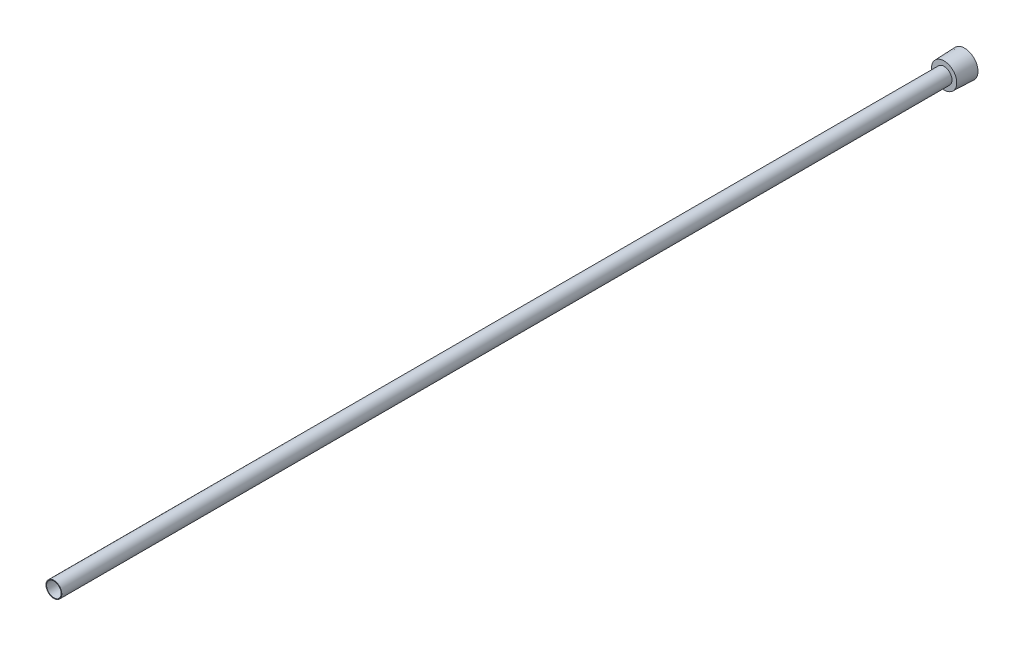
from build123d import *

# Parameters (mm, degrees)
SKETCH2_R          = 3.65125
CUT_EXTRUDE1_DEPTH = 458.29871103
CUT_EXTRUDE2_DEPTH = 6.35


with BuildPart() as part:
    # Sketch1 → Revolve1 (revolve)
    with BuildSketch(Plane(origin=(0, 0, 0), x_dir=(0, 0, -1), z_dir=(1, 0, 0)), mode=Mode.PRIVATE) as revolve1_sk:
        Polygon((0, 0), (-457.2, 0), (-457.2, 3.96875), (-10.3124, 3.96875), (-10.3124, 6.342143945), (0, 6.7183), align=None)
    revolve(revolve1_sk.sketch.rotate(Axis((0, 0, 331.124179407), (0, 0, -1)), 90), axis=Axis((0, 0, 331.124179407), (0, 0, -1)))

    # Sketch2 → Cut-Extrude1 (cut, through all)
    with BuildSketch(Plane.XY.offset(457.2)):
        Circle(SKETCH2_R)
    extrude(amount=-CUT_EXTRUDE1_DEPTH, mode=Mode.SUBTRACT)

    # Sketch3 → Cut-Extrude2 (cut)
    with BuildSketch(Plane(origin=(0, 0, 0), x_dir=(-1, 0, 0), z_dir=(0, 0, -1))):
        Polygon((-4.7625, -2.749630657), (0, -5.499261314), (4.7625, -2.749630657), (4.7625, 2.749630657), (0, 5.499261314), (-4.7625, 2.749630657), align=None)
    extrude(amount=-CUT_EXTRUDE2_DEPTH, mode=Mode.SUBTRACT)


solid = part.part
